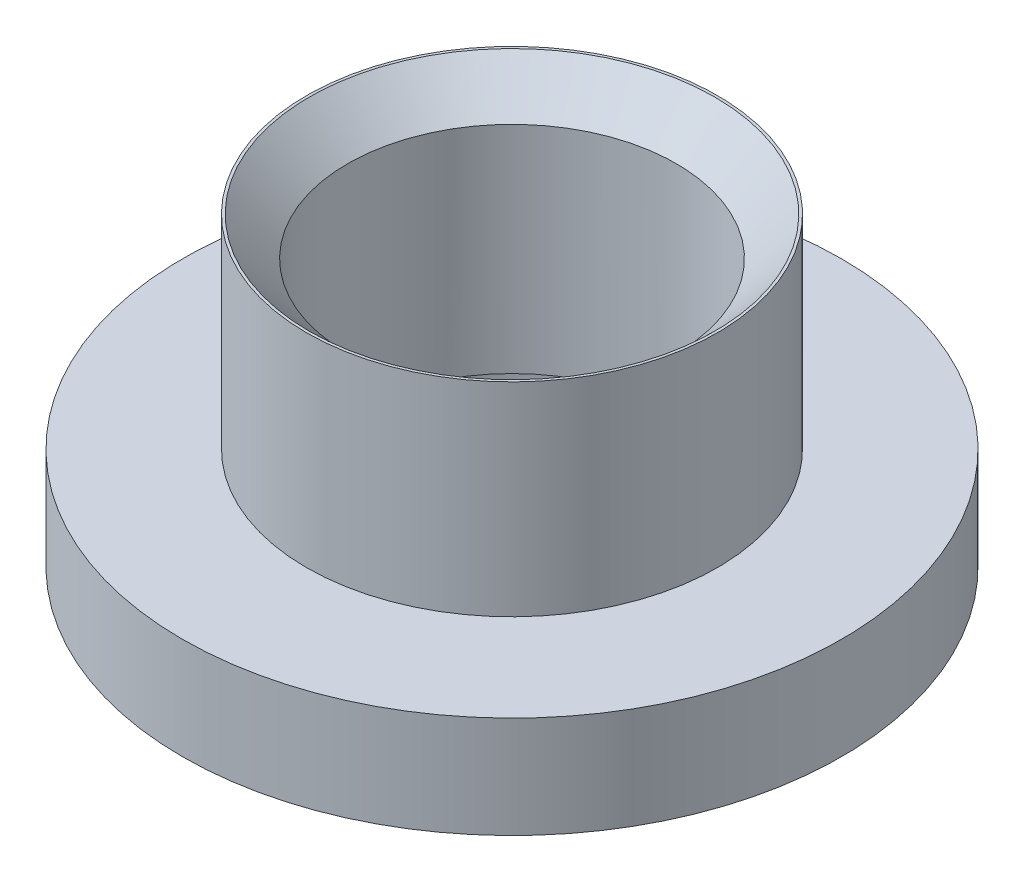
from build123d import *

# Parameters (mm, degrees)
SKETCH1_R               = 10.287
EXTRUDE1_DEPTH          = 9.525
SKETCH2_R               = 6.2992
EXTRUDE2_DEPTH          = 1.5875
SKETCH5_W               = 9.768384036
SKETCH5_H               = 20.918904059
SKETCH4_R               = 5.1308
F_7_16_28_UNEF_2B_DEPTH = 18.38879993
CHAMFER1_2_011_SIZE     = 1.20015


with BuildPart() as part:
    # Sketch1 → Extrude1 (new body)
    with BuildSketch(Plane(origin=(0, 0, 0), x_dir=(1, 0, 0), z_dir=(0, 1, 0))):
        with Locations(Location((0, 0, 0), (0, 0, 270))):
            Circle(SKETCH1_R)
    extrude(amount=EXTRUDE1_DEPTH)

    # Sketch2 → Extrude2 (cut)
    with BuildSketch(Plane.XZ):
        with Locations(Location((0, 0, 0), (0, 0, 270))):
            Circle(SKETCH2_R)
    extrude(amount=-EXTRUDE2_DEPTH, mode=Mode.SUBTRACT)

    # Sketch5 → 5dia (revolve, cut)
    with BuildSketch(Plane.XY, mode=Mode.PRIVATE) as f_5dia_sk:
        with Locations((-11.297692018, 13.63445203)):
            Rectangle(SKETCH5_W, SKETCH5_H)
    revolve(f_5dia_sk.sketch.rotate(Axis((0, 0, 0), (0, -1, 0)), 90), axis=Axis((0, 0, 0), (0, -1, 0)), mode=Mode.SUBTRACT)

    # Sketch4 → 7_16-28 UNEF-2B (cut, through all)
    with BuildSketch(Plane(origin=(0, 9.525, 0), x_dir=(1, 0, 0), z_dir=(0, 1, 0))):
        with Locations(Location((0, 0, 0), (0, 0, 270))):
            Circle(SKETCH4_R)
    extrude(amount=-F_7_16_28_UNEF_2B_DEPTH, mode=Mode.SUBTRACT)

    # Chamfer1-_2-011
    chamfer1_2_011_edges = [part.edges().sort_by_distance(p)[0] for p in [
        (0, 9.525, -5.1308),
    ]]
    chamfer(chamfer1_2_011_edges, length=CHAMFER1_2_011_SIZE)

    # Sketch7 → Groove for AS 568-016_ O-Ring1 (revolve, cut)
    with BuildSketch(Plane(origin=(0, 0, 0), x_dir=(0, 0, -1), z_dir=(-1, 0, 0)), mode=Mode.PRIVATE) as groove_for_as_568_016_o_ring1_sk:
        with BuildLine():
            Line((7.777514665, -1.038137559), (7.686689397, 0))
            Line((7.686689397, 0), (10.042510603, 0))
            Line((10.042510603, 0), (9.951685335, -1.038137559))
            ThreePointArc((9.951685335, -1.038137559), (9.870251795, -1.203268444), (9.698651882, -1.27))
            Line((9.698651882, -1.27), (8.030548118, -1.27))
            ThreePointArc((8.030548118, -1.27), (7.858948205, -1.203268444), (7.777514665, -1.038137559))
        make_face()
    revolve(groove_for_as_568_016_o_ring1_sk.sketch.rotate(Axis((0, -50, 0), (0, 1, 0)), 180), axis=Axis((0, -50, 0), (0, 1, 0)), mode=Mode.SUBTRACT)


solid = part.part
